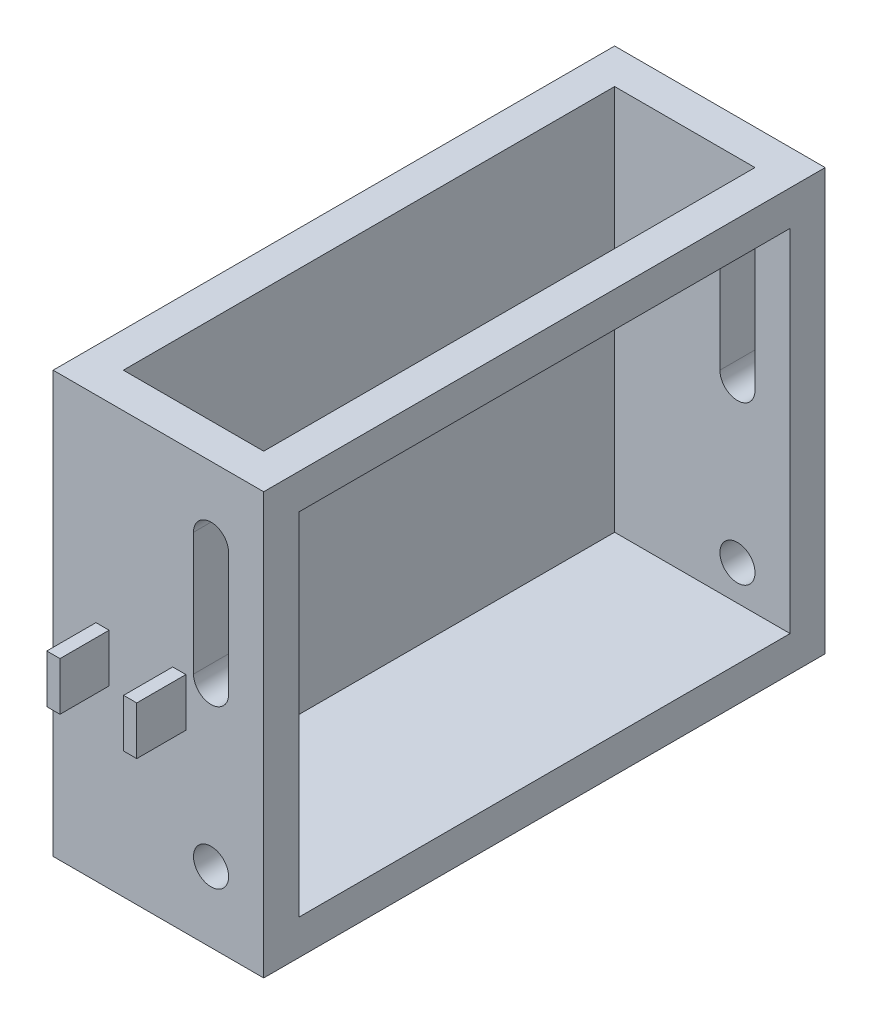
ISO-10303-21;
HEADER;
FILE_DESCRIPTION(('STEP AP214'),'2;1');
FILE_NAME('part.step','',(''),(''),'','','');
FILE_SCHEMA(('AUTOMOTIVE_DESIGN { 1 0 10303 214 1 1 1 1 }'));
ENDSEC;
DATA;
#1=APPLICATION_CONTEXT('core data for automotive mechanical design processes');
#2=APPLICATION_PROTOCOL_DEFINITION('international standard','automotive_design',2000,#1);
#3=PRODUCT_CONTEXT('',#1,'mechanical');
#4=PRODUCT('Part','Part','',(#3));
#5=PRODUCT_RELATED_PRODUCT_CATEGORY('part','',(#4));
#6=PRODUCT_DEFINITION_FORMATION('','',#4);
#7=PRODUCT_DEFINITION_CONTEXT('part definition',#1,'design');
#8=PRODUCT_DEFINITION('design','',#6,#7);
#9=PRODUCT_DEFINITION_SHAPE('','',#8);
#10=(LENGTH_UNIT() NAMED_UNIT(*) SI_UNIT(.MILLI.,.METRE.));
#11=(NAMED_UNIT(*) PLANE_ANGLE_UNIT() SI_UNIT($,.RADIAN.));
#12=(NAMED_UNIT(*) SI_UNIT($,.STERADIAN.) SOLID_ANGLE_UNIT());
#13=UNCERTAINTY_MEASURE_WITH_UNIT(LENGTH_MEASURE(1.E-05),#10,'distance_accuracy_value','');
#14=(GEOMETRIC_REPRESENTATION_CONTEXT(3) GLOBAL_UNCERTAINTY_ASSIGNED_CONTEXT((#13)) GLOBAL_UNIT_ASSIGNED_CONTEXT((#10,
#11,#12)) REPRESENTATION_CONTEXT('',''));
#15=CARTESIAN_POINT('',(0.,0.,0.));
#16=DIRECTION('',(0.,0.,1.));
#17=DIRECTION('',(1.,0.,0.));
#18=AXIS2_PLACEMENT_3D('',#15,#16,#17);
#19=CARTESIAN_POINT('',(0.,12.7,0.));
#20=DIRECTION('',(0.,-1.,0.));
#21=DIRECTION('',(0.,0.,-1.));
#22=AXIS2_PLACEMENT_3D('',#19,#20,#21);
#23=PLANE('',#22);
#24=DIRECTION('',(0.,0.,-1.));
#25=VECTOR('',#24,1.);
#26=CARTESIAN_POINT('',(12.7,12.7,0.));
#27=LINE('',#26,#25);
#28=CARTESIAN_POINT('',(12.7,12.7,-12.7));
#29=VERTEX_POINT('',#28);
#30=CARTESIAN_POINT('',(12.7,12.7,-190.5));
#31=VERTEX_POINT('',#30);
#32=EDGE_CURVE('E303',#29,#31,#27,.T.);
#33=ORIENTED_EDGE('',*,*,#32,.F.);
#34=DIRECTION('',(-1.,0.,0.));
#35=VECTOR('',#34,1.);
#36=CARTESIAN_POINT('',(0.,12.7,-12.7));
#37=LINE('',#36,#35);
#38=CARTESIAN_POINT('',(76.2,12.7,-12.7));
#39=VERTEX_POINT('',#38);
#40=EDGE_CURVE('E584',#39,#29,#37,.T.);
#41=ORIENTED_EDGE('',*,*,#40,.F.);
#42=DIRECTION('',(0.,0.,-1.));
#43=VECTOR('',#42,1.);
#44=CARTESIAN_POINT('',(76.2,12.7,0.));
#45=LINE('',#44,#43);
#46=CARTESIAN_POINT('',(76.2,12.7,-190.5));
#47=VERTEX_POINT('',#46);
#48=EDGE_CURVE('E603',#39,#47,#45,.T.);
#49=ORIENTED_EDGE('',*,*,#48,.T.);
#50=DIRECTION('',(1.,0.,0.));
#51=VECTOR('',#50,1.);
#52=CARTESIAN_POINT('',(0.,12.7,-190.5));
#53=LINE('',#52,#51);
#54=EDGE_CURVE('E595',#31,#47,#53,.T.);
#55=ORIENTED_EDGE('',*,*,#54,.F.);
#56=EDGE_LOOP('',(#33,#41,#49,#55));
#57=FACE_BOUND('',#56,.T.);
#58=ADVANCED_FACE('F39',(#57),#23,.F.);
#59=CARTESIAN_POINT('',(0.,139.7,-190.5));
#60=DIRECTION('',(0.,0.,-1.));
#61=DIRECTION('',(-1.,0.,0.));
#62=AXIS2_PLACEMENT_3D('',#59,#60,#61);
#63=PLANE('',#62);
#64=DIRECTION('',(0.,1.,0.));
#65=VECTOR('',#64,1.);
#66=CARTESIAN_POINT('',(50.8,139.7,-190.5));
#67=LINE('',#66,#65);
#68=CARTESIAN_POINT('',(50.8,82.55,-190.5));
#69=VERTEX_POINT('',#68);
#70=CARTESIAN_POINT('',(50.8,127.,-190.5));
#71=VERTEX_POINT('',#70);
#72=EDGE_CURVE('E460',#69,#71,#67,.T.);
#73=ORIENTED_EDGE('',*,*,#72,.T.);
#74=CARTESIAN_POINT('',(57.15,127.,-190.5));
#75=DIRECTION('',(0.,0.,-1.));
#76=DIRECTION('',(-1.,0.,0.));
#77=AXIS2_PLACEMENT_3D('',#74,#75,#76);
#78=CIRCLE('',#77,6.34999999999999);
#79=CARTESIAN_POINT('',(63.5,127.,-190.5));
#80=VERTEX_POINT('',#79);
#81=EDGE_CURVE('E525',#71,#80,#78,.T.);
#82=ORIENTED_EDGE('',*,*,#81,.T.);
#83=DIRECTION('',(0.,-1.,0.));
#84=VECTOR('',#83,1.);
#85=CARTESIAN_POINT('',(63.5,139.7,-190.5));
#86=LINE('',#85,#84);
#87=CARTESIAN_POINT('',(63.5,82.55,-190.5));
#88=VERTEX_POINT('',#87);
#89=EDGE_CURVE('E521',#80,#88,#86,.T.);
#90=ORIENTED_EDGE('',*,*,#89,.T.);
#91=CARTESIAN_POINT('',(57.15,82.55,-190.5));
#92=DIRECTION('',(0.,0.,-1.));
#93=DIRECTION('',(-1.,0.,0.));
#94=AXIS2_PLACEMENT_3D('',#91,#92,#93);
#95=CIRCLE('',#94,6.34999999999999);
#96=EDGE_CURVE('E517',#88,#69,#95,.T.);
#97=ORIENTED_EDGE('',*,*,#96,.T.);
#98=EDGE_LOOP('',(#73,#82,#90,#97));
#99=FACE_BOUND('',#98,.T.);
#100=CARTESIAN_POINT('',(57.15,25.4,-190.5));
#101=DIRECTION('',(0.,0.,-1.));
#102=DIRECTION('',(-1.,0.,0.));
#103=AXIS2_PLACEMENT_3D('',#100,#101,#102);
#104=CIRCLE('',#103,6.35);
#105=CARTESIAN_POINT('',(50.8,25.4,-190.5));
#106=VERTEX_POINT('',#105);
#107=EDGE_CURVE('E529',#106,#106,#104,.T.);
#108=ORIENTED_EDGE('',*,*,#107,.T.);
#109=EDGE_LOOP('',(#108));
#110=FACE_BOUND('',#109,.T.);
#111=DIRECTION('',(0.,-1.,0.));
#112=VECTOR('',#111,1.);
#113=CARTESIAN_POINT('',(12.7,152.4,-190.5));
#114=LINE('',#113,#112);
#115=CARTESIAN_POINT('',(12.7,152.4,-190.5));
#116=VERTEX_POINT('',#115);
#117=EDGE_CURVE('E56',#116,#31,#114,.T.);
#118=ORIENTED_EDGE('',*,*,#117,.T.);
#119=ORIENTED_EDGE('',*,*,#54,.T.);
#120=DIRECTION('',(0.,-1.,0.));
#121=VECTOR('',#120,1.);
#122=CARTESIAN_POINT('',(76.2,139.7,-190.5));
#123=LINE('',#122,#121);
#124=CARTESIAN_POINT('',(76.2,139.7,-190.5));
#125=VERTEX_POINT('',#124);
#126=EDGE_CURVE('E598',#125,#47,#123,.T.);
#127=ORIENTED_EDGE('',*,*,#126,.F.);
#128=DIRECTION('',(1.,0.,0.));
#129=VECTOR('',#128,1.);
#130=CARTESIAN_POINT('',(0.,139.7,-190.5));
#131=LINE('',#130,#129);
#132=CARTESIAN_POINT('',(63.5,139.7,-190.5));
#133=VERTEX_POINT('',#132);
#134=EDGE_CURVE('E577',#133,#125,#131,.T.);
#135=ORIENTED_EDGE('',*,*,#134,.F.);
#136=DIRECTION('',(0.,-1.,0.));
#137=VECTOR('',#136,1.);
#138=CARTESIAN_POINT('',(63.5,152.4,-190.5));
#139=LINE('',#138,#137);
#140=CARTESIAN_POINT('',(63.5,152.4,-190.5));
#141=VERTEX_POINT('',#140);
#142=EDGE_CURVE('E552',#141,#133,#139,.T.);
#143=ORIENTED_EDGE('',*,*,#142,.F.);
#144=DIRECTION('',(-1.,0.,0.));
#145=VECTOR('',#144,1.);
#146=CARTESIAN_POINT('',(12.7,152.4,-190.5));
#147=LINE('',#146,#145);
#148=EDGE_CURVE('E544',#141,#116,#147,.T.);
#149=ORIENTED_EDGE('',*,*,#148,.T.);
#150=EDGE_LOOP('',(#118,#119,#127,#135,#143,#149));
#151=FACE_BOUND('',#150,.T.);
#152=ADVANCED_FACE('F697',(#99,#110,#151),#63,.F.);
#153=CARTESIAN_POINT('',(0.,139.7,-12.7));
#154=DIRECTION('',(0.,0.,1.));
#155=DIRECTION('',(1.,0.,0.));
#156=AXIS2_PLACEMENT_3D('',#153,#154,#155);
#157=PLANE('',#156);
#158=DIRECTION('',(0.,1.,0.));
#159=VECTOR('',#158,1.);
#160=CARTESIAN_POINT('',(63.5,139.7,-12.7));
#161=LINE('',#160,#159);
#162=CARTESIAN_POINT('',(63.5,82.55,-12.7));
#163=VERTEX_POINT('',#162);
#164=CARTESIAN_POINT('',(63.5,127.,-12.7));
#165=VERTEX_POINT('',#164);
#166=EDGE_CURVE('E49',#163,#165,#161,.T.);
#167=ORIENTED_EDGE('',*,*,#166,.T.);
#168=CARTESIAN_POINT('',(57.15,127.,-12.7));
#169=DIRECTION('',(0.,0.,1.));
#170=DIRECTION('',(1.,0.,0.));
#171=AXIS2_PLACEMENT_3D('',#168,#169,#170);
#172=CIRCLE('',#171,6.34999999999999);
#173=CARTESIAN_POINT('',(50.8,127.,-12.7));
#174=VERTEX_POINT('',#173);
#175=EDGE_CURVE('E11',#165,#174,#172,.T.);
#176=ORIENTED_EDGE('',*,*,#175,.T.);
#177=DIRECTION('',(0.,-1.,0.));
#178=VECTOR('',#177,1.);
#179=CARTESIAN_POINT('',(50.8,139.7,-12.7));
#180=LINE('',#179,#178);
#181=CARTESIAN_POINT('',(50.8,82.55,-12.7));
#182=VERTEX_POINT('',#181);
#183=EDGE_CURVE('E635',#174,#182,#180,.T.);
#184=ORIENTED_EDGE('',*,*,#183,.T.);
#185=CARTESIAN_POINT('',(57.15,82.55,-12.7));
#186=DIRECTION('',(0.,0.,1.));
#187=DIRECTION('',(1.,0.,0.));
#188=AXIS2_PLACEMENT_3D('',#185,#186,#187);
#189=CIRCLE('',#188,6.34999999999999);
#190=EDGE_CURVE('E639',#182,#163,#189,.T.);
#191=ORIENTED_EDGE('',*,*,#190,.T.);
#192=EDGE_LOOP('',(#167,#176,#184,#191));
#193=FACE_BOUND('',#192,.T.);
#194=CARTESIAN_POINT('',(57.15,25.4,-12.7));
#195=DIRECTION('',(0.,0.,1.));
#196=DIRECTION('',(1.,0.,0.));
#197=AXIS2_PLACEMENT_3D('',#194,#195,#196);
#198=CIRCLE('',#197,6.35);
#199=CARTESIAN_POINT('',(63.5,25.4,-12.7));
#200=VERTEX_POINT('',#199);
#201=EDGE_CURVE('E43',#200,#200,#198,.T.);
#202=ORIENTED_EDGE('',*,*,#201,.T.);
#203=EDGE_LOOP('',(#202));
#204=FACE_BOUND('',#203,.T.);
#205=ORIENTED_EDGE('',*,*,#40,.T.);
#206=DIRECTION('',(0.,-1.,0.));
#207=VECTOR('',#206,1.);
#208=CARTESIAN_POINT('',(12.7,152.4,-12.7));
#209=LINE('',#208,#207);
#210=CARTESIAN_POINT('',(12.7,152.4,-12.7));
#211=VERTEX_POINT('',#210);
#212=EDGE_CURVE('E64',#211,#29,#209,.T.);
#213=ORIENTED_EDGE('',*,*,#212,.F.);
#214=DIRECTION('',(1.,0.,0.));
#215=VECTOR('',#214,1.);
#216=CARTESIAN_POINT('',(12.7,152.4,-12.7));
#217=LINE('',#216,#215);
#218=CARTESIAN_POINT('',(63.5,152.4,-12.7));
#219=VERTEX_POINT('',#218);
#220=EDGE_CURVE('E537',#211,#219,#217,.T.);
#221=ORIENTED_EDGE('',*,*,#220,.T.);
#222=DIRECTION('',(0.,-1.,0.));
#223=VECTOR('',#222,1.);
#224=CARTESIAN_POINT('',(63.5,152.4,-12.7));
#225=LINE('',#224,#223);
#226=CARTESIAN_POINT('',(63.5,139.7,-12.7));
#227=VERTEX_POINT('',#226);
#228=EDGE_CURVE('E556',#219,#227,#225,.T.);
#229=ORIENTED_EDGE('',*,*,#228,.T.);
#230=DIRECTION('',(-1.,0.,0.));
#231=VECTOR('',#230,1.);
#232=CARTESIAN_POINT('',(0.,139.7,-12.7));
#233=LINE('',#232,#231);
#234=CARTESIAN_POINT('',(76.2,139.7,-12.7));
#235=VERTEX_POINT('',#234);
#236=EDGE_CURVE('E585',#235,#227,#233,.T.);
#237=ORIENTED_EDGE('',*,*,#236,.F.);
#238=DIRECTION('',(0.,-1.,0.));
#239=VECTOR('',#238,1.);
#240=CARTESIAN_POINT('',(76.2,139.7,-12.7));
#241=LINE('',#240,#239);
#242=EDGE_CURVE('E588',#235,#39,#241,.T.);
#243=ORIENTED_EDGE('',*,*,#242,.T.);
#244=EDGE_LOOP('',(#205,#213,#221,#229,#237,#243));
#245=FACE_BOUND('',#244,.T.);
#246=ADVANCED_FACE('F646',(#193,#204,#245),#157,.F.);
#247=CARTESIAN_POINT('',(0.,12.7,0.));
#248=DIRECTION('',(0.,0.,-1.));
#249=DIRECTION('',(-1.,0.,0.));
#250=AXIS2_PLACEMENT_3D('',#247,#248,#249);
#251=PLANE('',#250);
#252=DIRECTION('',(1.,0.,0.));
#253=VECTOR('',#252,1.);
#254=CARTESIAN_POINT('',(0.,0.,0.));
#255=LINE('',#254,#253);
#256=CARTESIAN_POINT('',(0.,0.,0.));
#257=VERTEX_POINT('',#256);
#258=CARTESIAN_POINT('',(76.2,0.,0.));
#259=VERTEX_POINT('',#258);
#260=EDGE_CURVE('E612',#257,#259,#255,.T.);
#261=ORIENTED_EDGE('',*,*,#260,.T.);
#262=DIRECTION('',(0.,-1.,0.));
#263=VECTOR('',#262,1.);
#264=CARTESIAN_POINT('',(76.2,12.7,0.));
#265=LINE('',#264,#263);
#266=CARTESIAN_POINT('',(76.2,152.4,0.));
#267=VERTEX_POINT('',#266);
#268=EDGE_CURVE('E627',#267,#259,#265,.T.);
#269=ORIENTED_EDGE('',*,*,#268,.F.);
#270=DIRECTION('',(1.,0.,0.));
#271=VECTOR('',#270,1.);
#272=CARTESIAN_POINT('',(0.,152.4,0.));
#273=LINE('',#272,#271);
#274=CARTESIAN_POINT('',(0.,152.4,0.));
#275=VERTEX_POINT('',#274);
#276=EDGE_CURVE('E570',#275,#267,#273,.T.);
#277=ORIENTED_EDGE('',*,*,#276,.F.);
#278=DIRECTION('',(0.,-1.,0.));
#279=VECTOR('',#278,1.);
#280=CARTESIAN_POINT('',(0.,12.7,0.));
#281=LINE('',#280,#279);
#282=EDGE_CURVE('E631',#275,#257,#281,.T.);
#283=ORIENTED_EDGE('',*,*,#282,.T.);
#284=EDGE_LOOP('',(#261,#269,#277,#283));
#285=FACE_BOUND('',#284,.T.);
#286=DIRECTION('',(0.,-1.,0.));
#287=VECTOR('',#286,1.);
#288=CARTESIAN_POINT('',(43.27525,81.026,0.));
#289=LINE('',#288,#287);
#290=CARTESIAN_POINT('',(43.27525,81.026,0.));
#291=VERTEX_POINT('',#290);
#292=CARTESIAN_POINT('',(43.27525,63.5635,0.));
#293=VERTEX_POINT('',#292);
#294=EDGE_CURVE('E365',#291,#293,#289,.T.);
#295=ORIENTED_EDGE('',*,*,#294,.F.);
#296=DIRECTION('',(-1.,0.,0.));
#297=VECTOR('',#296,1.);
#298=CARTESIAN_POINT('',(43.27525,81.026,0.));
#299=LINE('',#298,#297);
#300=CARTESIAN_POINT('',(48.03775,81.026,0.));
#301=VERTEX_POINT('',#300);
#302=EDGE_CURVE('E371',#301,#291,#299,.T.);
#303=ORIENTED_EDGE('',*,*,#302,.F.);
#304=DIRECTION('',(0.,1.,0.));
#305=VECTOR('',#304,1.);
#306=CARTESIAN_POINT('',(48.03775,81.026,0.));
#307=LINE('',#306,#305);
#308=CARTESIAN_POINT('',(48.03775,63.5635,0.));
#309=VERTEX_POINT('',#308);
#310=EDGE_CURVE('E388',#309,#301,#307,.T.);
#311=ORIENTED_EDGE('',*,*,#310,.F.);
#312=DIRECTION('',(1.,0.,0.));
#313=VECTOR('',#312,1.);
#314=CARTESIAN_POINT('',(43.27525,63.5635,0.));
#315=LINE('',#314,#313);
#316=EDGE_CURVE('E384',#293,#309,#315,.T.);
#317=ORIENTED_EDGE('',*,*,#316,.F.);
#318=EDGE_LOOP('',(#295,#303,#311,#317));
#319=FACE_BOUND('',#318,.T.);
#320=DIRECTION('',(0.,-1.,0.));
#321=VECTOR('',#320,1.);
#322=CARTESIAN_POINT('',(50.8,127.,0.));
#323=LINE('',#322,#321);
#324=CARTESIAN_POINT('',(50.8,127.,0.));
#325=VERTEX_POINT('',#324);
#326=CARTESIAN_POINT('',(50.8,82.55,0.));
#327=VERTEX_POINT('',#326);
#328=EDGE_CURVE('E486',#325,#327,#323,.T.);
#329=ORIENTED_EDGE('',*,*,#328,.F.);
#330=CARTESIAN_POINT('',(57.15,127.,0.));
#331=DIRECTION('',(0.,0.,1.));
#332=DIRECTION('',(1.,0.,0.));
#333=AXIS2_PLACEMENT_3D('',#330,#331,#332);
#334=CIRCLE('',#333,6.34999999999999);
#335=CARTESIAN_POINT('',(63.5,127.,0.));
#336=VERTEX_POINT('',#335);
#337=EDGE_CURVE('E455',#336,#325,#334,.T.);
#338=ORIENTED_EDGE('',*,*,#337,.F.);
#339=DIRECTION('',(0.,1.,0.));
#340=VECTOR('',#339,1.);
#341=CARTESIAN_POINT('',(63.5,127.,0.));
#342=LINE('',#341,#340);
#343=CARTESIAN_POINT('',(63.5,82.55,0.));
#344=VERTEX_POINT('',#343);
#345=EDGE_CURVE('E471',#344,#336,#342,.T.);
#346=ORIENTED_EDGE('',*,*,#345,.F.);
#347=CARTESIAN_POINT('',(57.15,82.55,0.));
#348=DIRECTION('',(0.,0.,1.));
#349=DIRECTION('',(1.,0.,0.));
#350=AXIS2_PLACEMENT_3D('',#347,#348,#349);
#351=CIRCLE('',#350,6.34999999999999);
#352=EDGE_CURVE('E490',#327,#344,#351,.T.);
#353=ORIENTED_EDGE('',*,*,#352,.F.);
#354=EDGE_LOOP('',(#329,#338,#346,#353));
#355=FACE_BOUND('',#354,.T.);
#356=CARTESIAN_POINT('',(57.15,25.4,0.));
#357=DIRECTION('',(0.,0.,1.));
#358=DIRECTION('',(1.,0.,0.));
#359=AXIS2_PLACEMENT_3D('',#356,#357,#358);
#360=CIRCLE('',#359,6.35);
#361=CARTESIAN_POINT('',(63.5,25.4,0.));
#362=VERTEX_POINT('',#361);
#363=EDGE_CURVE('E461',#362,#362,#360,.T.);
#364=ORIENTED_EDGE('',*,*,#363,.F.);
#365=EDGE_LOOP('',(#364));
#366=FACE_BOUND('',#365,.T.);
#367=DIRECTION('',(0.,-1.,0.));
#368=VECTOR('',#367,1.);
#369=CARTESIAN_POINT('',(15.494,81.026,0.));
#370=LINE('',#369,#368);
#371=CARTESIAN_POINT('',(15.494,81.026,0.));
#372=VERTEX_POINT('',#371);
#373=CARTESIAN_POINT('',(15.494,63.5635,0.));
#374=VERTEX_POINT('',#373);
#375=EDGE_CURVE('E410',#372,#374,#370,.T.);
#376=ORIENTED_EDGE('',*,*,#375,.F.);
#377=DIRECTION('',(-1.,0.,0.));
#378=VECTOR('',#377,1.);
#379=CARTESIAN_POINT('',(15.494,81.026,0.));
#380=LINE('',#379,#378);
#381=CARTESIAN_POINT('',(20.2565,81.026,0.));
#382=VERTEX_POINT('',#381);
#383=EDGE_CURVE('E416',#382,#372,#380,.T.);
#384=ORIENTED_EDGE('',*,*,#383,.F.);
#385=DIRECTION('',(0.,1.,0.));
#386=VECTOR('',#385,1.);
#387=CARTESIAN_POINT('',(20.2565,81.026,0.));
#388=LINE('',#387,#386);
#389=CARTESIAN_POINT('',(20.2565,63.5635,0.));
#390=VERTEX_POINT('',#389);
#391=EDGE_CURVE('E433',#390,#382,#388,.T.);
#392=ORIENTED_EDGE('',*,*,#391,.F.);
#393=DIRECTION('',(1.,0.,0.));
#394=VECTOR('',#393,1.);
#395=CARTESIAN_POINT('',(15.494,63.5635,0.));
#396=LINE('',#395,#394);
#397=EDGE_CURVE('E429',#374,#390,#396,.T.);
#398=ORIENTED_EDGE('',*,*,#397,.F.);
#399=EDGE_LOOP('',(#376,#384,#392,#398));
#400=FACE_BOUND('',#399,.T.);
#401=ADVANCED_FACE('F669',(#285,#319,#355,#366,#400),#251,.F.);
#402=CARTESIAN_POINT('',(0.,12.7,0.));
#403=DIRECTION('',(1.,0.,0.));
#404=DIRECTION('',(0.,0.,-1.));
#405=AXIS2_PLACEMENT_3D('',#402,#403,#404);
#406=PLANE('',#405);
#407=DIRECTION('',(0.,0.,1.));
#408=VECTOR('',#407,1.);
#409=CARTESIAN_POINT('',(0.,0.,0.));
#410=LINE('',#409,#408);
#411=CARTESIAN_POINT('',(0.,0.,-203.2));
#412=VERTEX_POINT('',#411);
#413=EDGE_CURVE('E602',#412,#257,#410,.T.);
#414=ORIENTED_EDGE('',*,*,#413,.T.);
#415=ORIENTED_EDGE('',*,*,#282,.F.);
#416=DIRECTION('',(0.,0.,1.));
#417=VECTOR('',#416,1.);
#418=CARTESIAN_POINT('',(0.,152.4,-203.2));
#419=LINE('',#418,#417);
#420=CARTESIAN_POINT('',(0.,152.4,-203.2));
#421=VERTEX_POINT('',#420);
#422=EDGE_CURVE('E566',#421,#275,#419,.T.);
#423=ORIENTED_EDGE('',*,*,#422,.F.);
#424=DIRECTION('',(0.,-1.,0.));
#425=VECTOR('',#424,1.);
#426=CARTESIAN_POINT('',(0.,12.7,-203.2));
#427=LINE('',#426,#425);
#428=EDGE_CURVE('E607',#421,#412,#427,.T.);
#429=ORIENTED_EDGE('',*,*,#428,.T.);
#430=EDGE_LOOP('',(#414,#415,#423,#429));
#431=FACE_BOUND('',#430,.T.);
#432=ADVANCED_FACE('F41',(#431),#406,.F.);
#433=CARTESIAN_POINT('',(76.2,12.7,0.));
#434=DIRECTION('',(-1.,0.,0.));
#435=DIRECTION('',(0.,0.,1.));
#436=AXIS2_PLACEMENT_3D('',#433,#434,#435);
#437=PLANE('',#436);
#438=DIRECTION('',(0.,-1.,0.));
#439=VECTOR('',#438,1.);
#440=CARTESIAN_POINT('',(76.2,12.7,-203.2));
#441=LINE('',#440,#439);
#442=CARTESIAN_POINT('',(76.2,152.4,-203.2));
#443=VERTEX_POINT('',#442);
#444=CARTESIAN_POINT('',(76.2,0.,-203.2));
#445=VERTEX_POINT('',#444);
#446=EDGE_CURVE('E623',#443,#445,#441,.T.);
#447=ORIENTED_EDGE('',*,*,#446,.F.);
#448=DIRECTION('',(0.,0.,-1.));
#449=VECTOR('',#448,1.);
#450=CARTESIAN_POINT('',(76.2,152.4,0.));
#451=LINE('',#450,#449);
#452=EDGE_CURVE('E573',#267,#443,#451,.T.);
#453=ORIENTED_EDGE('',*,*,#452,.F.);
#454=ORIENTED_EDGE('',*,*,#268,.T.);
#455=DIRECTION('',(0.,0.,-1.));
#456=VECTOR('',#455,1.);
#457=CARTESIAN_POINT('',(76.2,0.,0.));
#458=LINE('',#457,#456);
#459=EDGE_CURVE('E615',#259,#445,#458,.T.);
#460=ORIENTED_EDGE('',*,*,#459,.T.);
#461=EDGE_LOOP('',(#447,#453,#454,#460));
#462=FACE_BOUND('',#461,.T.);
#463=DIRECTION('',(0.,0.,-1.));
#464=VECTOR('',#463,1.);
#465=CARTESIAN_POINT('',(76.2,139.7,0.));
#466=LINE('',#465,#464);
#467=EDGE_CURVE('E562',#235,#125,#466,.T.);
#468=ORIENTED_EDGE('',*,*,#467,.T.);
#469=ORIENTED_EDGE('',*,*,#126,.T.);
#470=ORIENTED_EDGE('',*,*,#48,.F.);
#471=ORIENTED_EDGE('',*,*,#242,.F.);
#472=EDGE_LOOP('',(#468,#469,#470,#471));
#473=FACE_BOUND('',#472,.T.);
#474=ADVANCED_FACE('F716',(#462,#473),#437,.F.);
#475=CARTESIAN_POINT('',(0.,12.7,-203.2));
#476=DIRECTION('',(0.,0.,1.));
#477=DIRECTION('',(1.,0.,0.));
#478=AXIS2_PLACEMENT_3D('',#475,#476,#477);
#479=PLANE('',#478);
#480=ORIENTED_EDGE('',*,*,#428,.F.);
#481=DIRECTION('',(-1.,0.,0.));
#482=VECTOR('',#481,1.);
#483=CARTESIAN_POINT('',(76.2,152.4,-203.2));
#484=LINE('',#483,#482);
#485=EDGE_CURVE('E563',#443,#421,#484,.T.);
#486=ORIENTED_EDGE('',*,*,#485,.F.);
#487=ORIENTED_EDGE('',*,*,#446,.T.);
#488=DIRECTION('',(-1.,0.,0.));
#489=VECTOR('',#488,1.);
#490=CARTESIAN_POINT('',(0.,0.,-203.2));
#491=LINE('',#490,#489);
#492=EDGE_CURVE('E608',#445,#412,#491,.T.);
#493=ORIENTED_EDGE('',*,*,#492,.T.);
#494=EDGE_LOOP('',(#480,#486,#487,#493));
#495=FACE_BOUND('',#494,.T.);
#496=DIRECTION('',(0.,1.,0.));
#497=VECTOR('',#496,1.);
#498=CARTESIAN_POINT('',(63.5,127.,-203.2));
#499=LINE('',#498,#497);
#500=CARTESIAN_POINT('',(63.5,82.55,-203.2));
#501=VERTEX_POINT('',#500);
#502=CARTESIAN_POINT('',(63.5,127.,-203.2));
#503=VERTEX_POINT('',#502);
#504=EDGE_CURVE('E479',#501,#503,#499,.T.);
#505=ORIENTED_EDGE('',*,*,#504,.T.);
#506=CARTESIAN_POINT('',(57.15,127.,-203.2));
#507=DIRECTION('',(0.,0.,1.));
#508=DIRECTION('',(1.,0.,0.));
#509=AXIS2_PLACEMENT_3D('',#506,#507,#508);
#510=CIRCLE('',#509,6.34999999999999);
#511=CARTESIAN_POINT('',(50.8,127.,-203.2));
#512=VERTEX_POINT('',#511);
#513=EDGE_CURVE('E466',#503,#512,#510,.T.);
#514=ORIENTED_EDGE('',*,*,#513,.T.);
#515=DIRECTION('',(0.,-1.,0.));
#516=VECTOR('',#515,1.);
#517=CARTESIAN_POINT('',(50.8,127.,-203.2));
#518=LINE('',#517,#516);
#519=CARTESIAN_POINT('',(50.8,82.55,-203.2));
#520=VERTEX_POINT('',#519);
#521=EDGE_CURVE('E470',#512,#520,#518,.T.);
#522=ORIENTED_EDGE('',*,*,#521,.T.);
#523=CARTESIAN_POINT('',(57.15,82.55,-203.2));
#524=DIRECTION('',(0.,0.,1.));
#525=DIRECTION('',(1.,0.,0.));
#526=AXIS2_PLACEMENT_3D('',#523,#524,#525);
#527=CIRCLE('',#526,6.34999999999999);
#528=EDGE_CURVE('E475',#520,#501,#527,.T.);
#529=ORIENTED_EDGE('',*,*,#528,.T.);
#530=EDGE_LOOP('',(#505,#514,#522,#529));
#531=FACE_BOUND('',#530,.T.);
#532=CARTESIAN_POINT('',(57.15,25.4,-203.2));
#533=DIRECTION('',(0.,0.,1.));
#534=DIRECTION('',(1.,0.,0.));
#535=AXIS2_PLACEMENT_3D('',#532,#533,#534);
#536=CIRCLE('',#535,6.35);
#537=CARTESIAN_POINT('',(63.5,25.4,-203.2));
#538=VERTEX_POINT('',#537);
#539=EDGE_CURVE('E456',#538,#538,#536,.T.);
#540=ORIENTED_EDGE('',*,*,#539,.T.);
#541=EDGE_LOOP('',(#540));
#542=FACE_BOUND('',#541,.T.);
#543=DIRECTION('',(-1.,0.,0.));
#544=VECTOR('',#543,1.);
#545=CARTESIAN_POINT('',(15.494,81.026,-203.2));
#546=LINE('',#545,#544);
#547=CARTESIAN_POINT('',(20.2565,81.026,-203.2));
#548=VERTEX_POINT('',#547);
#549=CARTESIAN_POINT('',(15.494,81.026,-203.2));
#550=VERTEX_POINT('',#549);
#551=EDGE_CURVE('E342',#548,#550,#546,.T.);
#552=ORIENTED_EDGE('',*,*,#551,.T.);
#553=DIRECTION('',(0.,-1.,0.));
#554=VECTOR('',#553,1.);
#555=CARTESIAN_POINT('',(15.494,81.026,-203.2));
#556=LINE('',#555,#554);
#557=CARTESIAN_POINT('',(15.494,63.5635,-203.2));
#558=VERTEX_POINT('',#557);
#559=EDGE_CURVE('E275',#550,#558,#556,.T.);
#560=ORIENTED_EDGE('',*,*,#559,.T.);
#561=DIRECTION('',(1.,0.,0.));
#562=VECTOR('',#561,1.);
#563=CARTESIAN_POINT('',(15.494,63.5635,-203.2));
#564=LINE('',#563,#562);
#565=CARTESIAN_POINT('',(20.2565,63.5635,-203.2));
#566=VERTEX_POINT('',#565);
#567=EDGE_CURVE('E326',#558,#566,#564,.T.);
#568=ORIENTED_EDGE('',*,*,#567,.T.);
#569=DIRECTION('',(0.,1.,0.));
#570=VECTOR('',#569,1.);
#571=CARTESIAN_POINT('',(20.2565,81.026,-203.2));
#572=LINE('',#571,#570);
#573=EDGE_CURVE('E346',#566,#548,#572,.T.);
#574=ORIENTED_EDGE('',*,*,#573,.T.);
#575=EDGE_LOOP('',(#552,#560,#568,#574));
#576=FACE_BOUND('',#575,.T.);
#577=DIRECTION('',(-1.,0.,0.));
#578=VECTOR('',#577,1.);
#579=CARTESIAN_POINT('',(43.27525,81.026,-203.2));
#580=LINE('',#579,#578);
#581=CARTESIAN_POINT('',(48.03775,81.026,-203.2));
#582=VERTEX_POINT('',#581);
#583=CARTESIAN_POINT('',(43.27525,81.026,-203.2));
#584=VERTEX_POINT('',#583);
#585=EDGE_CURVE('E302',#582,#584,#580,.T.);
#586=ORIENTED_EDGE('',*,*,#585,.T.);
#587=DIRECTION('',(0.,-1.,0.));
#588=VECTOR('',#587,1.);
#589=CARTESIAN_POINT('',(43.27525,81.026,-203.2));
#590=LINE('',#589,#588);
#591=CARTESIAN_POINT('',(43.27525,63.5635,-203.2));
#592=VERTEX_POINT('',#591);
#593=EDGE_CURVE('E269',#584,#592,#590,.T.);
#594=ORIENTED_EDGE('',*,*,#593,.T.);
#595=DIRECTION('',(1.,0.,0.));
#596=VECTOR('',#595,1.);
#597=CARTESIAN_POINT('',(43.27525,63.5635,-203.2));
#598=LINE('',#597,#596);
#599=CARTESIAN_POINT('',(48.03775,63.5635,-203.2));
#600=VERTEX_POINT('',#599);
#601=EDGE_CURVE('E287',#592,#600,#598,.T.);
#602=ORIENTED_EDGE('',*,*,#601,.T.);
#603=DIRECTION('',(0.,1.,0.));
#604=VECTOR('',#603,1.);
#605=CARTESIAN_POINT('',(48.03775,81.026,-203.2));
#606=LINE('',#605,#604);
#607=EDGE_CURVE('E306',#600,#582,#606,.T.);
#608=ORIENTED_EDGE('',*,*,#607,.T.);
#609=EDGE_LOOP('',(#586,#594,#602,#608));
#610=FACE_BOUND('',#609,.T.);
#611=ADVANCED_FACE('F712',(#495,#531,#542,#576,#610),#479,.F.);
#612=CARTESIAN_POINT('',(0.,0.,0.));
#613=DIRECTION('',(0.,-1.,0.));
#614=DIRECTION('',(0.,0.,-1.));
#615=AXIS2_PLACEMENT_3D('',#612,#613,#614);
#616=PLANE('',#615);
#617=ORIENTED_EDGE('',*,*,#413,.F.);
#618=ORIENTED_EDGE('',*,*,#492,.F.);
#619=ORIENTED_EDGE('',*,*,#459,.F.);
#620=ORIENTED_EDGE('',*,*,#260,.F.);
#621=EDGE_LOOP('',(#617,#618,#619,#620));
#622=FACE_BOUND('',#621,.T.);
#623=ADVANCED_FACE('F708',(#622),#616,.T.);
#624=CARTESIAN_POINT('',(0.,139.7,0.));
#625=DIRECTION('',(0.,1.,0.));
#626=DIRECTION('',(0.,0.,1.));
#627=AXIS2_PLACEMENT_3D('',#624,#625,#626);
#628=PLANE('',#627);
#629=DIRECTION('',(0.,0.,-1.));
#630=VECTOR('',#629,1.);
#631=CARTESIAN_POINT('',(63.5,139.7,-190.5));
#632=LINE('',#631,#630);
#633=EDGE_CURVE('E533',#227,#133,#632,.T.);
#634=ORIENTED_EDGE('',*,*,#633,.T.);
#635=ORIENTED_EDGE('',*,*,#134,.T.);
#636=ORIENTED_EDGE('',*,*,#467,.F.);
#637=ORIENTED_EDGE('',*,*,#236,.T.);
#638=EDGE_LOOP('',(#634,#635,#636,#637));
#639=FACE_BOUND('',#638,.T.);
#640=ADVANCED_FACE('F711',(#639),#628,.F.);
#641=CARTESIAN_POINT('',(0.,152.4,0.));
#642=DIRECTION('',(0.,1.,0.));
#643=DIRECTION('',(0.,0.,1.));
#644=AXIS2_PLACEMENT_3D('',#641,#642,#643);
#645=PLANE('',#644);
#646=DIRECTION('',(0.,0.,1.));
#647=VECTOR('',#646,1.);
#648=CARTESIAN_POINT('',(12.7,152.4,-190.5));
#649=LINE('',#648,#647);
#650=EDGE_CURVE('E534',#116,#211,#649,.T.);
#651=ORIENTED_EDGE('',*,*,#650,.F.);
#652=ORIENTED_EDGE('',*,*,#148,.F.);
#653=DIRECTION('',(0.,0.,-1.));
#654=VECTOR('',#653,1.);
#655=CARTESIAN_POINT('',(63.5,152.4,-190.5));
#656=LINE('',#655,#654);
#657=EDGE_CURVE('E540',#219,#141,#656,.T.);
#658=ORIENTED_EDGE('',*,*,#657,.F.);
#659=ORIENTED_EDGE('',*,*,#220,.F.);
#660=EDGE_LOOP('',(#651,#652,#658,#659));
#661=FACE_BOUND('',#660,.T.);
#662=ORIENTED_EDGE('',*,*,#485,.T.);
#663=ORIENTED_EDGE('',*,*,#422,.T.);
#664=ORIENTED_EDGE('',*,*,#276,.T.);
#665=ORIENTED_EDGE('',*,*,#452,.T.);
#666=EDGE_LOOP('',(#662,#663,#664,#665));
#667=FACE_BOUND('',#666,.T.);
#668=ADVANCED_FACE('F968',(#661,#667),#645,.T.);
#669=CARTESIAN_POINT('',(12.7,152.4,-190.5));
#670=DIRECTION('',(1.,0.,0.));
#671=DIRECTION('',(0.,0.,-1.));
#672=AXIS2_PLACEMENT_3D('',#669,#670,#671);
#673=PLANE('',#672);
#674=ORIENTED_EDGE('',*,*,#212,.T.);
#675=ORIENTED_EDGE('',*,*,#32,.T.);
#676=ORIENTED_EDGE('',*,*,#117,.F.);
#677=ORIENTED_EDGE('',*,*,#650,.T.);
#678=EDGE_LOOP('',(#674,#675,#676,#677));
#679=FACE_BOUND('',#678,.T.);
#680=ADVANCED_FACE('F789',(#679),#673,.T.);
#681=CARTESIAN_POINT('',(63.5,152.4,-190.5));
#682=DIRECTION('',(-1.,0.,0.));
#683=DIRECTION('',(0.,0.,1.));
#684=AXIS2_PLACEMENT_3D('',#681,#682,#683);
#685=PLANE('',#684);
#686=ORIENTED_EDGE('',*,*,#633,.F.);
#687=ORIENTED_EDGE('',*,*,#228,.F.);
#688=ORIENTED_EDGE('',*,*,#657,.T.);
#689=ORIENTED_EDGE('',*,*,#142,.T.);
#690=EDGE_LOOP('',(#686,#687,#688,#689));
#691=FACE_BOUND('',#690,.T.);
#692=ADVANCED_FACE('F967',(#691),#685,.T.);
#693=CARTESIAN_POINT('',(50.8,127.,-203.2));
#694=DIRECTION('',(-1.,0.,0.));
#695=DIRECTION('',(0.,0.,1.));
#696=AXIS2_PLACEMENT_3D('',#693,#694,#695);
#697=PLANE('',#696);
#698=DIRECTION('',(0.,0.,1.));
#699=VECTOR('',#698,1.);
#700=CARTESIAN_POINT('',(50.8,127.,-203.2));
#701=LINE('',#700,#699);
#702=EDGE_CURVE('E483',#174,#325,#701,.T.);
#703=ORIENTED_EDGE('',*,*,#702,.T.);
#704=ORIENTED_EDGE('',*,*,#328,.T.);
#705=DIRECTION('',(0.,0.,1.));
#706=VECTOR('',#705,1.);
#707=CARTESIAN_POINT('',(50.8,82.55,-203.2));
#708=LINE('',#707,#706);
#709=EDGE_CURVE('E510',#182,#327,#708,.T.);
#710=ORIENTED_EDGE('',*,*,#709,.F.);
#711=ORIENTED_EDGE('',*,*,#183,.F.);
#712=EDGE_LOOP('',(#703,#704,#710,#711));
#713=FACE_BOUND('',#712,.T.);
#714=ADVANCED_FACE('F665',(#713),#697,.F.);
#715=CARTESIAN_POINT('',(57.15,82.55,-203.2));
#716=DIRECTION('',(0.,0.,1.));
#717=DIRECTION('',(1.,0.,0.));
#718=AXIS2_PLACEMENT_3D('',#715,#716,#717);
#719=CYLINDRICAL_SURFACE('',#718,6.34999999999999);
#720=ORIENTED_EDGE('',*,*,#709,.T.);
#721=ORIENTED_EDGE('',*,*,#352,.T.);
#722=DIRECTION('',(0.,0.,1.));
#723=VECTOR('',#722,1.);
#724=CARTESIAN_POINT('',(63.5,82.55,-203.2));
#725=LINE('',#724,#723);
#726=EDGE_CURVE('E505',#163,#344,#725,.T.);
#727=ORIENTED_EDGE('',*,*,#726,.F.);
#728=ORIENTED_EDGE('',*,*,#190,.F.);
#729=EDGE_LOOP('',(#720,#721,#727,#728));
#730=FACE_BOUND('',#729,.T.);
#731=ADVANCED_FACE('F654',(#730),#719,.F.);
#732=CARTESIAN_POINT('',(63.5,127.,-203.2));
#733=DIRECTION('',(1.,0.,0.));
#734=DIRECTION('',(0.,0.,-1.));
#735=AXIS2_PLACEMENT_3D('',#732,#733,#734);
#736=PLANE('',#735);
#737=ORIENTED_EDGE('',*,*,#726,.T.);
#738=ORIENTED_EDGE('',*,*,#345,.T.);
#739=DIRECTION('',(0.,0.,1.));
#740=VECTOR('',#739,1.);
#741=CARTESIAN_POINT('',(63.5,127.,-203.2));
#742=LINE('',#741,#740);
#743=EDGE_CURVE('E500',#165,#336,#742,.T.);
#744=ORIENTED_EDGE('',*,*,#743,.F.);
#745=ORIENTED_EDGE('',*,*,#166,.F.);
#746=EDGE_LOOP('',(#737,#738,#744,#745));
#747=FACE_BOUND('',#746,.T.);
#748=ADVANCED_FACE('F652',(#747),#736,.F.);
#749=CARTESIAN_POINT('',(57.15,127.,-203.2));
#750=DIRECTION('',(0.,0.,1.));
#751=DIRECTION('',(1.,0.,0.));
#752=AXIS2_PLACEMENT_3D('',#749,#750,#751);
#753=CYLINDRICAL_SURFACE('',#752,6.34999999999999);
#754=ORIENTED_EDGE('',*,*,#743,.T.);
#755=ORIENTED_EDGE('',*,*,#337,.T.);
#756=ORIENTED_EDGE('',*,*,#702,.F.);
#757=ORIENTED_EDGE('',*,*,#175,.F.);
#758=EDGE_LOOP('',(#754,#755,#756,#757));
#759=FACE_BOUND('',#758,.T.);
#760=ADVANCED_FACE('F671',(#759),#753,.F.);
#761=CARTESIAN_POINT('',(57.15,25.4,-203.2));
#762=DIRECTION('',(0.,0.,1.));
#763=DIRECTION('',(1.,0.,0.));
#764=AXIS2_PLACEMENT_3D('',#761,#762,#763);
#765=CYLINDRICAL_SURFACE('',#764,6.35);
#766=ORIENTED_EDGE('',*,*,#363,.T.);
#767=EDGE_LOOP('',(#766));
#768=FACE_BOUND('',#767,.T.);
#769=ORIENTED_EDGE('',*,*,#201,.F.);
#770=EDGE_LOOP('',(#769));
#771=FACE_BOUND('',#770,.T.);
#772=ADVANCED_FACE('F677',(#768,#771),#765,.F.);
#773=EDGE_CURVE('E511',#512,#71,#701,.T.);
#774=ORIENTED_EDGE('',*,*,#773,.F.);
#775=ORIENTED_EDGE('',*,*,#513,.F.);
#776=EDGE_CURVE('E465',#503,#80,#742,.T.);
#777=ORIENTED_EDGE('',*,*,#776,.T.);
#778=ORIENTED_EDGE('',*,*,#81,.F.);
#779=EDGE_LOOP('',(#774,#775,#777,#778));
#780=FACE_BOUND('',#779,.T.);
#781=ADVANCED_FACE('F679',(#780),#753,.F.);
#782=ORIENTED_EDGE('',*,*,#776,.F.);
#783=ORIENTED_EDGE('',*,*,#504,.F.);
#784=EDGE_CURVE('E501',#501,#88,#725,.T.);
#785=ORIENTED_EDGE('',*,*,#784,.T.);
#786=ORIENTED_EDGE('',*,*,#89,.F.);
#787=EDGE_LOOP('',(#782,#783,#785,#786));
#788=FACE_BOUND('',#787,.T.);
#789=ADVANCED_FACE('F687',(#788),#736,.F.);
#790=ORIENTED_EDGE('',*,*,#784,.F.);
#791=ORIENTED_EDGE('',*,*,#528,.F.);
#792=EDGE_CURVE('E506',#520,#69,#708,.T.);
#793=ORIENTED_EDGE('',*,*,#792,.T.);
#794=ORIENTED_EDGE('',*,*,#96,.F.);
#795=EDGE_LOOP('',(#790,#791,#793,#794));
#796=FACE_BOUND('',#795,.T.);
#797=ADVANCED_FACE('F1028',(#796),#719,.F.);
#798=ORIENTED_EDGE('',*,*,#792,.F.);
#799=ORIENTED_EDGE('',*,*,#521,.F.);
#800=ORIENTED_EDGE('',*,*,#773,.T.);
#801=ORIENTED_EDGE('',*,*,#72,.F.);
#802=EDGE_LOOP('',(#798,#799,#800,#801));
#803=FACE_BOUND('',#802,.T.);
#804=ADVANCED_FACE('F694',(#803),#697,.F.);
#805=ORIENTED_EDGE('',*,*,#539,.F.);
#806=EDGE_LOOP('',(#805));
#807=FACE_BOUND('',#806,.T.);
#808=ORIENTED_EDGE('',*,*,#107,.F.);
#809=EDGE_LOOP('',(#808));
#810=FACE_BOUND('',#809,.T.);
#811=ADVANCED_FACE('F682',(#807,#810),#765,.F.);
#812=CARTESIAN_POINT('',(15.494,81.026,17.78));
#813=DIRECTION('',(1.,0.,0.));
#814=DIRECTION('',(0.,1.,0.));
#815=AXIS2_PLACEMENT_3D('',#812,#813,#814);
#816=PLANE('',#815);
#817=ORIENTED_EDGE('',*,*,#375,.T.);
#818=DIRECTION('',(0.,0.,-1.));
#819=VECTOR('',#818,1.);
#820=CARTESIAN_POINT('',(15.494,63.5635,17.78));
#821=LINE('',#820,#819);
#822=CARTESIAN_POINT('',(15.494,63.5635,17.78));
#823=VERTEX_POINT('',#822);
#824=EDGE_CURVE('E451',#823,#374,#821,.T.);
#825=ORIENTED_EDGE('',*,*,#824,.F.);
#826=DIRECTION('',(0.,-1.,0.));
#827=VECTOR('',#826,1.);
#828=CARTESIAN_POINT('',(15.494,81.026,17.78));
#829=LINE('',#828,#827);
#830=CARTESIAN_POINT('',(15.494,81.026,17.78));
#831=VERTEX_POINT('',#830);
#832=EDGE_CURVE('E411',#831,#823,#829,.T.);
#833=ORIENTED_EDGE('',*,*,#832,.F.);
#834=DIRECTION('',(0.,0.,-1.));
#835=VECTOR('',#834,1.);
#836=CARTESIAN_POINT('',(15.494,81.026,17.78));
#837=LINE('',#836,#835);
#838=EDGE_CURVE('E425',#831,#372,#837,.T.);
#839=ORIENTED_EDGE('',*,*,#838,.T.);
#840=EDGE_LOOP('',(#817,#825,#833,#839));
#841=FACE_BOUND('',#840,.T.);
#842=ADVANCED_FACE('F693',(#841),#816,.F.);
#843=CARTESIAN_POINT('',(15.494,63.5635,17.78));
#844=DIRECTION('',(0.,1.,0.));
#845=DIRECTION('',(0.,0.,1.));
#846=AXIS2_PLACEMENT_3D('',#843,#844,#845);
#847=PLANE('',#846);
#848=ORIENTED_EDGE('',*,*,#397,.T.);
#849=DIRECTION('',(0.,0.,-1.));
#850=VECTOR('',#849,1.);
#851=CARTESIAN_POINT('',(20.2565,63.5635,17.78));
#852=LINE('',#851,#850);
#853=CARTESIAN_POINT('',(20.2565,63.5635,17.78));
#854=VERTEX_POINT('',#853);
#855=EDGE_CURVE('E447',#854,#390,#852,.T.);
#856=ORIENTED_EDGE('',*,*,#855,.F.);
#857=DIRECTION('',(1.,0.,0.));
#858=VECTOR('',#857,1.);
#859=CARTESIAN_POINT('',(15.494,63.5635,17.78));
#860=LINE('',#859,#858);
#861=EDGE_CURVE('E415',#823,#854,#860,.T.);
#862=ORIENTED_EDGE('',*,*,#861,.F.);
#863=ORIENTED_EDGE('',*,*,#824,.T.);
#864=EDGE_LOOP('',(#848,#856,#862,#863));
#865=FACE_BOUND('',#864,.T.);
#866=ADVANCED_FACE('F768',(#865),#847,.F.);
#867=CARTESIAN_POINT('',(20.2565,81.026,17.78));
#868=DIRECTION('',(-1.,0.,0.));
#869=DIRECTION('',(0.,-1.,0.));
#870=AXIS2_PLACEMENT_3D('',#867,#868,#869);
#871=PLANE('',#870);
#872=ORIENTED_EDGE('',*,*,#391,.T.);
#873=DIRECTION('',(0.,0.,-1.));
#874=VECTOR('',#873,1.);
#875=CARTESIAN_POINT('',(20.2565,81.026,17.78));
#876=LINE('',#875,#874);
#877=CARTESIAN_POINT('',(20.2565,81.026,17.78));
#878=VERTEX_POINT('',#877);
#879=EDGE_CURVE('E443',#878,#382,#876,.T.);
#880=ORIENTED_EDGE('',*,*,#879,.F.);
#881=DIRECTION('',(0.,1.,0.));
#882=VECTOR('',#881,1.);
#883=CARTESIAN_POINT('',(20.2565,81.026,17.78));
#884=LINE('',#883,#882);
#885=EDGE_CURVE('E419',#854,#878,#884,.T.);
#886=ORIENTED_EDGE('',*,*,#885,.F.);
#887=ORIENTED_EDGE('',*,*,#855,.T.);
#888=EDGE_LOOP('',(#872,#880,#886,#887));
#889=FACE_BOUND('',#888,.T.);
#890=ADVANCED_FACE('F764',(#889),#871,.F.);
#891=CARTESIAN_POINT('',(15.494,81.026,17.78));
#892=DIRECTION('',(0.,-1.,0.));
#893=DIRECTION('',(0.,0.,-1.));
#894=AXIS2_PLACEMENT_3D('',#891,#892,#893);
#895=PLANE('',#894);
#896=ORIENTED_EDGE('',*,*,#383,.T.);
#897=ORIENTED_EDGE('',*,*,#838,.F.);
#898=DIRECTION('',(-1.,0.,0.));
#899=VECTOR('',#898,1.);
#900=CARTESIAN_POINT('',(15.494,81.026,17.78));
#901=LINE('',#900,#899);
#902=EDGE_CURVE('E422',#878,#831,#901,.T.);
#903=ORIENTED_EDGE('',*,*,#902,.F.);
#904=ORIENTED_EDGE('',*,*,#879,.T.);
#905=EDGE_LOOP('',(#896,#897,#903,#904));
#906=FACE_BOUND('',#905,.T.);
#907=ADVANCED_FACE('F760',(#906),#895,.F.);
#908=CARTESIAN_POINT('',(0.,0.,17.78));
#909=DIRECTION('',(0.,0.,1.));
#910=DIRECTION('',(1.,0.,0.));
#911=AXIS2_PLACEMENT_3D('',#908,#909,#910);
#912=PLANE('',#911);
#913=ORIENTED_EDGE('',*,*,#832,.T.);
#914=ORIENTED_EDGE('',*,*,#861,.T.);
#915=ORIENTED_EDGE('',*,*,#885,.T.);
#916=ORIENTED_EDGE('',*,*,#902,.T.);
#917=EDGE_LOOP('',(#913,#914,#915,#916));
#918=FACE_BOUND('',#917,.T.);
#919=ADVANCED_FACE('F754',(#918),#912,.T.);
#920=CARTESIAN_POINT('',(43.27525,81.026,17.78));
#921=DIRECTION('',(1.,0.,0.));
#922=DIRECTION('',(0.,0.,-1.));
#923=AXIS2_PLACEMENT_3D('',#920,#921,#922);
#924=PLANE('',#923);
#925=ORIENTED_EDGE('',*,*,#294,.T.);
#926=DIRECTION('',(0.,0.,-1.));
#927=VECTOR('',#926,1.);
#928=CARTESIAN_POINT('',(43.27525,63.5635,17.78));
#929=LINE('',#928,#927);
#930=CARTESIAN_POINT('',(43.27525,63.5635,17.78));
#931=VERTEX_POINT('',#930);
#932=EDGE_CURVE('E406',#931,#293,#929,.T.);
#933=ORIENTED_EDGE('',*,*,#932,.F.);
#934=DIRECTION('',(0.,-1.,0.));
#935=VECTOR('',#934,1.);
#936=CARTESIAN_POINT('',(43.27525,81.026,17.78));
#937=LINE('',#936,#935);
#938=CARTESIAN_POINT('',(43.27525,81.026,17.78));
#939=VERTEX_POINT('',#938);
#940=EDGE_CURVE('E366',#939,#931,#937,.T.);
#941=ORIENTED_EDGE('',*,*,#940,.F.);
#942=DIRECTION('',(0.,0.,-1.));
#943=VECTOR('',#942,1.);
#944=CARTESIAN_POINT('',(43.27525,81.026,17.78));
#945=LINE('',#944,#943);
#946=EDGE_CURVE('E380',#939,#291,#945,.T.);
#947=ORIENTED_EDGE('',*,*,#946,.T.);
#948=EDGE_LOOP('',(#925,#933,#941,#947));
#949=FACE_BOUND('',#948,.T.);
#950=ADVANCED_FACE('F738',(#949),#924,.F.);
#951=CARTESIAN_POINT('',(43.27525,63.5635,17.78));
#952=DIRECTION('',(0.,1.,0.));
#953=DIRECTION('',(0.,0.,1.));
#954=AXIS2_PLACEMENT_3D('',#951,#952,#953);
#955=PLANE('',#954);
#956=ORIENTED_EDGE('',*,*,#316,.T.);
#957=DIRECTION('',(0.,0.,-1.));
#958=VECTOR('',#957,1.);
#959=CARTESIAN_POINT('',(48.03775,63.5635,17.78));
#960=LINE('',#959,#958);
#961=CARTESIAN_POINT('',(48.03775,63.5635,17.78));
#962=VERTEX_POINT('',#961);
#963=EDGE_CURVE('E402',#962,#309,#960,.T.);
#964=ORIENTED_EDGE('',*,*,#963,.F.);
#965=DIRECTION('',(1.,0.,0.));
#966=VECTOR('',#965,1.);
#967=CARTESIAN_POINT('',(43.27525,63.5635,17.78));
#968=LINE('',#967,#966);
#969=EDGE_CURVE('E370',#931,#962,#968,.T.);
#970=ORIENTED_EDGE('',*,*,#969,.F.);
#971=ORIENTED_EDGE('',*,*,#932,.T.);
#972=EDGE_LOOP('',(#956,#964,#970,#971));
#973=FACE_BOUND('',#972,.T.);
#974=ADVANCED_FACE('F746',(#973),#955,.F.);
#975=CARTESIAN_POINT('',(48.03775,81.026,17.78));
#976=DIRECTION('',(-1.,0.,0.));
#977=DIRECTION('',(0.,0.,1.));
#978=AXIS2_PLACEMENT_3D('',#975,#976,#977);
#979=PLANE('',#978);
#980=ORIENTED_EDGE('',*,*,#310,.T.);
#981=DIRECTION('',(0.,0.,-1.));
#982=VECTOR('',#981,1.);
#983=CARTESIAN_POINT('',(48.03775,81.026,17.78));
#984=LINE('',#983,#982);
#985=CARTESIAN_POINT('',(48.03775,81.026,17.78));
#986=VERTEX_POINT('',#985);
#987=EDGE_CURVE('E398',#986,#301,#984,.T.);
#988=ORIENTED_EDGE('',*,*,#987,.F.);
#989=DIRECTION('',(0.,1.,0.));
#990=VECTOR('',#989,1.);
#991=CARTESIAN_POINT('',(48.03775,81.026,17.78));
#992=LINE('',#991,#990);
#993=EDGE_CURVE('E374',#962,#986,#992,.T.);
#994=ORIENTED_EDGE('',*,*,#993,.F.);
#995=ORIENTED_EDGE('',*,*,#963,.T.);
#996=EDGE_LOOP('',(#980,#988,#994,#995));
#997=FACE_BOUND('',#996,.T.);
#998=ADVANCED_FACE('F744',(#997),#979,.F.);
#999=CARTESIAN_POINT('',(43.27525,81.026,17.78));
#1000=DIRECTION('',(0.,-1.,0.));
#1001=DIRECTION('',(0.,0.,-1.));
#1002=AXIS2_PLACEMENT_3D('',#999,#1000,#1001);
#1003=PLANE('',#1002);
#1004=ORIENTED_EDGE('',*,*,#302,.T.);
#1005=ORIENTED_EDGE('',*,*,#946,.F.);
#1006=DIRECTION('',(-1.,0.,0.));
#1007=VECTOR('',#1006,1.);
#1008=CARTESIAN_POINT('',(43.27525,81.026,17.78));
#1009=LINE('',#1008,#1007);
#1010=EDGE_CURVE('E377',#986,#939,#1009,.T.);
#1011=ORIENTED_EDGE('',*,*,#1010,.F.);
#1012=ORIENTED_EDGE('',*,*,#987,.T.);
#1013=EDGE_LOOP('',(#1004,#1005,#1011,#1012));
#1014=FACE_BOUND('',#1013,.T.);
#1015=ADVANCED_FACE('F734',(#1014),#1003,.F.);
#1016=CARTESIAN_POINT('',(0.,0.,17.78));
#1017=DIRECTION('',(0.,0.,1.));
#1018=DIRECTION('',(1.,0.,0.));
#1019=AXIS2_PLACEMENT_3D('',#1016,#1017,#1018);
#1020=PLANE('',#1019);
#1021=ORIENTED_EDGE('',*,*,#940,.T.);
#1022=ORIENTED_EDGE('',*,*,#969,.T.);
#1023=ORIENTED_EDGE('',*,*,#993,.T.);
#1024=ORIENTED_EDGE('',*,*,#1010,.T.);
#1025=EDGE_LOOP('',(#1021,#1022,#1023,#1024));
#1026=FACE_BOUND('',#1025,.T.);
#1027=ADVANCED_FACE('F740',(#1026),#1020,.T.);
#1028=CARTESIAN_POINT('',(15.494,81.026,-220.98));
#1029=DIRECTION('',(-1.,0.,0.));
#1030=DIRECTION('',(0.,-1.,0.));
#1031=AXIS2_PLACEMENT_3D('',#1028,#1029,#1030);
#1032=PLANE('',#1031);
#1033=ORIENTED_EDGE('',*,*,#559,.F.);
#1034=DIRECTION('',(0.,0.,1.));
#1035=VECTOR('',#1034,1.);
#1036=CARTESIAN_POINT('',(15.494,81.026,-220.98));
#1037=LINE('',#1036,#1035);
#1038=CARTESIAN_POINT('',(15.494,81.026,-220.98));
#1039=VERTEX_POINT('',#1038);
#1040=EDGE_CURVE('E362',#1039,#550,#1037,.T.);
#1041=ORIENTED_EDGE('',*,*,#1040,.F.);
#1042=DIRECTION('',(0.,-1.,0.));
#1043=VECTOR('',#1042,1.);
#1044=CARTESIAN_POINT('',(15.494,81.026,-220.98));
#1045=LINE('',#1044,#1043);
#1046=CARTESIAN_POINT('',(15.494,63.5635,-220.98));
#1047=VERTEX_POINT('',#1046);
#1048=EDGE_CURVE('E321',#1039,#1047,#1045,.T.);
#1049=ORIENTED_EDGE('',*,*,#1048,.T.);
#1050=DIRECTION('',(0.,0.,1.));
#1051=VECTOR('',#1050,1.);
#1052=CARTESIAN_POINT('',(15.494,63.5635,-220.98));
#1053=LINE('',#1052,#1051);
#1054=EDGE_CURVE('E338',#1047,#558,#1053,.T.);
#1055=ORIENTED_EDGE('',*,*,#1054,.T.);
#1056=EDGE_LOOP('',(#1033,#1041,#1049,#1055));
#1057=FACE_BOUND('',#1056,.T.);
#1058=ADVANCED_FACE('F835',(#1057),#1032,.T.);
#1059=CARTESIAN_POINT('',(15.494,81.026,-220.98));
#1060=DIRECTION('',(0.,1.,0.));
#1061=DIRECTION('',(0.,0.,1.));
#1062=AXIS2_PLACEMENT_3D('',#1059,#1060,#1061);
#1063=PLANE('',#1062);
#1064=ORIENTED_EDGE('',*,*,#551,.F.);
#1065=DIRECTION('',(0.,0.,1.));
#1066=VECTOR('',#1065,1.);
#1067=CARTESIAN_POINT('',(20.2565,81.026,-220.98));
#1068=LINE('',#1067,#1066);
#1069=CARTESIAN_POINT('',(20.2565,81.026,-220.98));
#1070=VERTEX_POINT('',#1069);
#1071=EDGE_CURVE('E359',#1070,#548,#1068,.T.);
#1072=ORIENTED_EDGE('',*,*,#1071,.F.);
#1073=DIRECTION('',(-1.,0.,0.));
#1074=VECTOR('',#1073,1.);
#1075=CARTESIAN_POINT('',(15.494,81.026,-220.98));
#1076=LINE('',#1075,#1074);
#1077=EDGE_CURVE('E325',#1070,#1039,#1076,.T.);
#1078=ORIENTED_EDGE('',*,*,#1077,.T.);
#1079=ORIENTED_EDGE('',*,*,#1040,.T.);
#1080=EDGE_LOOP('',(#1064,#1072,#1078,#1079));
#1081=FACE_BOUND('',#1080,.T.);
#1082=ADVANCED_FACE('F844',(#1081),#1063,.T.);
#1083=CARTESIAN_POINT('',(20.2565,81.026,-220.98));
#1084=DIRECTION('',(1.,0.,0.));
#1085=DIRECTION('',(0.,1.,0.));
#1086=AXIS2_PLACEMENT_3D('',#1083,#1084,#1085);
#1087=PLANE('',#1086);
#1088=ORIENTED_EDGE('',*,*,#573,.F.);
#1089=DIRECTION('',(0.,0.,1.));
#1090=VECTOR('',#1089,1.);
#1091=CARTESIAN_POINT('',(20.2565,63.5635,-220.98));
#1092=LINE('',#1091,#1090);
#1093=CARTESIAN_POINT('',(20.2565,63.5635,-220.98));
#1094=VERTEX_POINT('',#1093);
#1095=EDGE_CURVE('E355',#1094,#566,#1092,.T.);
#1096=ORIENTED_EDGE('',*,*,#1095,.F.);
#1097=DIRECTION('',(0.,1.,0.));
#1098=VECTOR('',#1097,1.);
#1099=CARTESIAN_POINT('',(20.2565,81.026,-220.98));
#1100=LINE('',#1099,#1098);
#1101=EDGE_CURVE('E330',#1094,#1070,#1100,.T.);
#1102=ORIENTED_EDGE('',*,*,#1101,.T.);
#1103=ORIENTED_EDGE('',*,*,#1071,.T.);
#1104=EDGE_LOOP('',(#1088,#1096,#1102,#1103));
#1105=FACE_BOUND('',#1104,.T.);
#1106=ADVANCED_FACE('F854',(#1105),#1087,.T.);
#1107=CARTESIAN_POINT('',(15.494,63.5635,-220.98));
#1108=DIRECTION('',(0.,-1.,0.));
#1109=DIRECTION('',(0.,0.,-1.));
#1110=AXIS2_PLACEMENT_3D('',#1107,#1108,#1109);
#1111=PLANE('',#1110);
#1112=ORIENTED_EDGE('',*,*,#567,.F.);
#1113=ORIENTED_EDGE('',*,*,#1054,.F.);
#1114=DIRECTION('',(1.,0.,0.));
#1115=VECTOR('',#1114,1.);
#1116=CARTESIAN_POINT('',(15.494,63.5635,-220.98));
#1117=LINE('',#1116,#1115);
#1118=EDGE_CURVE('E334',#1047,#1094,#1117,.T.);
#1119=ORIENTED_EDGE('',*,*,#1118,.T.);
#1120=ORIENTED_EDGE('',*,*,#1095,.T.);
#1121=EDGE_LOOP('',(#1112,#1113,#1119,#1120));
#1122=FACE_BOUND('',#1121,.T.);
#1123=ADVANCED_FACE('F864',(#1122),#1111,.T.);
#1124=CARTESIAN_POINT('',(0.,0.,-220.98));
#1125=DIRECTION('',(0.,0.,-1.));
#1126=DIRECTION('',(1.,0.,0.));
#1127=AXIS2_PLACEMENT_3D('',#1124,#1125,#1126);
#1128=PLANE('',#1127);
#1129=ORIENTED_EDGE('',*,*,#1048,.F.);
#1130=ORIENTED_EDGE('',*,*,#1077,.F.);
#1131=ORIENTED_EDGE('',*,*,#1101,.F.);
#1132=ORIENTED_EDGE('',*,*,#1118,.F.);
#1133=EDGE_LOOP('',(#1129,#1130,#1131,#1132));
#1134=FACE_BOUND('',#1133,.T.);
#1135=ADVANCED_FACE('F874',(#1134),#1128,.T.);
#1136=CARTESIAN_POINT('',(43.27525,81.026,-220.98));
#1137=DIRECTION('',(-1.,0.,0.));
#1138=DIRECTION('',(0.,0.,1.));
#1139=AXIS2_PLACEMENT_3D('',#1136,#1137,#1138);
#1140=PLANE('',#1139);
#1141=ORIENTED_EDGE('',*,*,#593,.F.);
#1142=DIRECTION('',(0.,0.,1.));
#1143=VECTOR('',#1142,1.);
#1144=CARTESIAN_POINT('',(43.27525,81.026,-220.98));
#1145=LINE('',#1144,#1143);
#1146=CARTESIAN_POINT('',(43.27525,81.026,-220.98));
#1147=VERTEX_POINT('',#1146);
#1148=EDGE_CURVE('E263',#1147,#584,#1145,.T.);
#1149=ORIENTED_EDGE('',*,*,#1148,.F.);
#1150=DIRECTION('',(0.,-1.,0.));
#1151=VECTOR('',#1150,1.);
#1152=CARTESIAN_POINT('',(43.27525,81.026,-220.98));
#1153=LINE('',#1152,#1151);
#1154=CARTESIAN_POINT('',(43.27525,63.5635,-220.98));
#1155=VERTEX_POINT('',#1154);
#1156=EDGE_CURVE('E266',#1147,#1155,#1153,.T.);
#1157=ORIENTED_EDGE('',*,*,#1156,.T.);
#1158=DIRECTION('',(0.,0.,1.));
#1159=VECTOR('',#1158,1.);
#1160=CARTESIAN_POINT('',(43.27525,63.5635,-220.98));
#1161=LINE('',#1160,#1159);
#1162=EDGE_CURVE('E299',#1155,#592,#1161,.T.);
#1163=ORIENTED_EDGE('',*,*,#1162,.T.);
#1164=EDGE_LOOP('',(#1141,#1149,#1157,#1163));
#1165=FACE_BOUND('',#1164,.T.);
#1166=ADVANCED_FACE('F265',(#1165),#1140,.T.);
#1167=CARTESIAN_POINT('',(43.27525,81.026,-220.98));
#1168=DIRECTION('',(0.,1.,0.));
#1169=DIRECTION('',(0.,0.,1.));
#1170=AXIS2_PLACEMENT_3D('',#1167,#1168,#1169);
#1171=PLANE('',#1170);
#1172=ORIENTED_EDGE('',*,*,#585,.F.);
#1173=DIRECTION('',(0.,0.,1.));
#1174=VECTOR('',#1173,1.);
#1175=CARTESIAN_POINT('',(48.03775,81.026,-220.98));
#1176=LINE('',#1175,#1174);
#1177=CARTESIAN_POINT('',(48.03775,81.026,-220.98));
#1178=VERTEX_POINT('',#1177);
#1179=EDGE_CURVE('E276',#1178,#582,#1176,.T.);
#1180=ORIENTED_EDGE('',*,*,#1179,.F.);
#1181=DIRECTION('',(-1.,0.,0.));
#1182=VECTOR('',#1181,1.);
#1183=CARTESIAN_POINT('',(43.27525,81.026,-220.98));
#1184=LINE('',#1183,#1182);
#1185=EDGE_CURVE('E282',#1178,#1147,#1184,.T.);
#1186=ORIENTED_EDGE('',*,*,#1185,.T.);
#1187=ORIENTED_EDGE('',*,*,#1148,.T.);
#1188=EDGE_LOOP('',(#1172,#1180,#1186,#1187));
#1189=FACE_BOUND('',#1188,.T.);
#1190=ADVANCED_FACE('F289',(#1189),#1171,.T.);
#1191=CARTESIAN_POINT('',(48.03775,81.026,-220.98));
#1192=DIRECTION('',(1.,0.,0.));
#1193=DIRECTION('',(0.,0.,-1.));
#1194=AXIS2_PLACEMENT_3D('',#1191,#1192,#1193);
#1195=PLANE('',#1194);
#1196=ORIENTED_EDGE('',*,*,#607,.F.);
#1197=DIRECTION('',(0.,0.,1.));
#1198=VECTOR('',#1197,1.);
#1199=CARTESIAN_POINT('',(48.03775,63.5635,-220.98));
#1200=LINE('',#1199,#1198);
#1201=CARTESIAN_POINT('',(48.03775,63.5635,-220.98));
#1202=VERTEX_POINT('',#1201);
#1203=EDGE_CURVE('E315',#1202,#600,#1200,.T.);
#1204=ORIENTED_EDGE('',*,*,#1203,.F.);
#1205=DIRECTION('',(0.,1.,0.));
#1206=VECTOR('',#1205,1.);
#1207=CARTESIAN_POINT('',(48.03775,81.026,-220.98));
#1208=LINE('',#1207,#1206);
#1209=EDGE_CURVE('E291',#1202,#1178,#1208,.T.);
#1210=ORIENTED_EDGE('',*,*,#1209,.T.);
#1211=ORIENTED_EDGE('',*,*,#1179,.T.);
#1212=EDGE_LOOP('',(#1196,#1204,#1210,#1211));
#1213=FACE_BOUND('',#1212,.T.);
#1214=ADVANCED_FACE('F901',(#1213),#1195,.T.);
#1215=CARTESIAN_POINT('',(43.27525,63.5635,-220.98));
#1216=DIRECTION('',(0.,-1.,0.));
#1217=DIRECTION('',(0.,0.,-1.));
#1218=AXIS2_PLACEMENT_3D('',#1215,#1216,#1217);
#1219=PLANE('',#1218);
#1220=ORIENTED_EDGE('',*,*,#601,.F.);
#1221=ORIENTED_EDGE('',*,*,#1162,.F.);
#1222=DIRECTION('',(1.,0.,0.));
#1223=VECTOR('',#1222,1.);
#1224=CARTESIAN_POINT('',(43.27525,63.5635,-220.98));
#1225=LINE('',#1224,#1223);
#1226=EDGE_CURVE('E285',#1155,#1202,#1225,.T.);
#1227=ORIENTED_EDGE('',*,*,#1226,.T.);
#1228=ORIENTED_EDGE('',*,*,#1203,.T.);
#1229=EDGE_LOOP('',(#1220,#1221,#1227,#1228));
#1230=FACE_BOUND('',#1229,.T.);
#1231=ADVANCED_FACE('F910',(#1230),#1219,.T.);
#1232=CARTESIAN_POINT('',(0.,0.,-220.98));
#1233=DIRECTION('',(0.,0.,-1.));
#1234=DIRECTION('',(1.,0.,0.));
#1235=AXIS2_PLACEMENT_3D('',#1232,#1233,#1234);
#1236=PLANE('',#1235);
#1237=ORIENTED_EDGE('',*,*,#1156,.F.);
#1238=ORIENTED_EDGE('',*,*,#1185,.F.);
#1239=ORIENTED_EDGE('',*,*,#1209,.F.);
#1240=ORIENTED_EDGE('',*,*,#1226,.F.);
#1241=EDGE_LOOP('',(#1237,#1238,#1239,#1240));
#1242=FACE_BOUND('',#1241,.T.);
#1243=ADVANCED_FACE('F280',(#1242),#1236,.T.);
#1244=CLOSED_SHELL('',(#58,#152,#246,#401,#432,#474,#611,#623,#640,#668,#680,#692,#714,#731,
#748,#760,#772,#781,#789,#797,#804,#811,#842,#866,#890,#907,#919,#950,#974,#998,#1015,#1027,
#1058,#1082,#1106,#1123,#1135,#1166,#1190,#1214,#1231,#1243));
#1245=MANIFOLD_SOLID_BREP('B2',#1244);
#1246=ADVANCED_BREP_SHAPE_REPRESENTATION('',(#18,#1245),#14);
#1247=SHAPE_DEFINITION_REPRESENTATION(#9,#1246);
ENDSEC;
END-ISO-10303-21;
